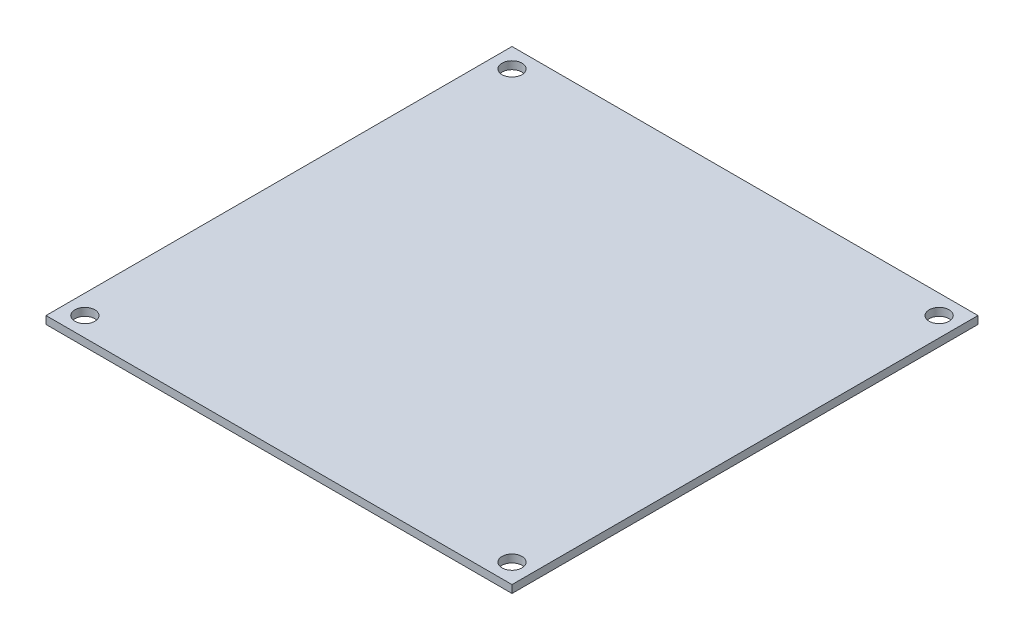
from build123d import *

# Parameters (mm, degrees)
SKETCH1_W                 = 76.2
SKETCH1_H                 = 76.2
EXTRUDE1_DEPTH            = 1.27
F_4_CLEARANCE_HOLE1_D     = 3.2639
F_4_CLEARANCE_HOLE1_DEPTH = 9.144
F_4_CLEARANCE_HOLE1_TIP   = 0.980574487


with BuildPart() as part:
    # Sketch1 → Extrude1 (new body)
    with BuildSketch(Plane(origin=(0, 0, 0), x_dir=(1, 0, 0), z_dir=(0, 1, 0))):
        with Locations((38.1, 38.1)):
            Rectangle(SKETCH1_W, SKETCH1_H)
    extrude(amount=-EXTRUDE1_DEPTH)

    # 4 Clearance Hole1
    with Locations(Plane(origin=(73.025, 0, -3.175), x_dir=(0, 0, 1), z_dir=(0, 1, 0))):
        with Locations((0, 0), (-69.85, -69.85), (0, -69.85), (-69.85, 0)):
            Hole(F_4_CLEARANCE_HOLE1_D / 2, depth=F_4_CLEARANCE_HOLE1_DEPTH)
            with Locations((0, 0, -(F_4_CLEARANCE_HOLE1_DEPTH + F_4_CLEARANCE_HOLE1_TIP / 2))):  # 118° drill point
                Cone(0, F_4_CLEARANCE_HOLE1_D / 2, F_4_CLEARANCE_HOLE1_TIP, mode=Mode.SUBTRACT)


solid = part.part
